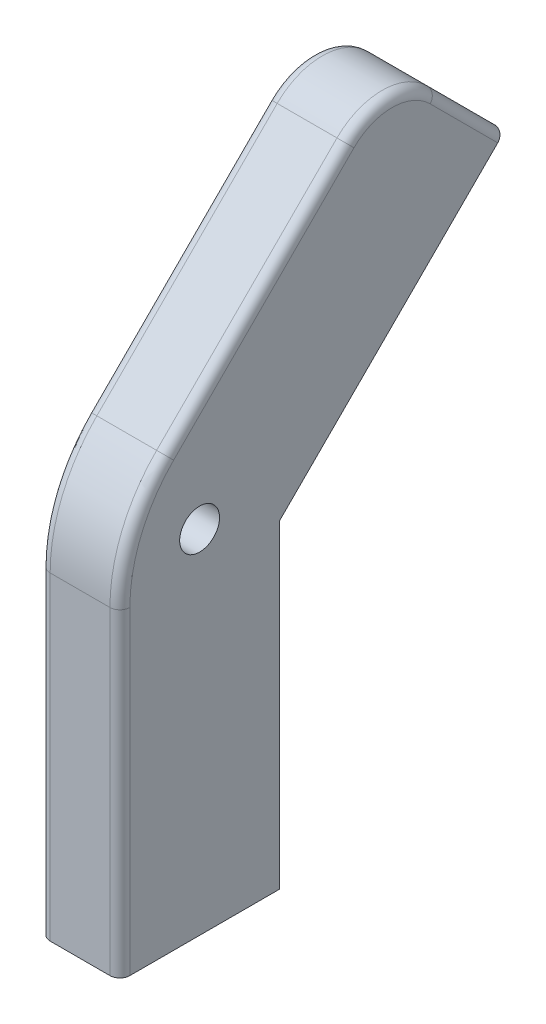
from build123d import *

# Parameters (mm, degrees)
EXTRUDE1_DEPTH = 3.175
SKETCH2_R      = 0.79375
EXTRUDE2_DEPTH = 21.653053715
FILLET2_R      = 2.54
FILLET3_R      = 0.396875


with BuildPart() as part:
    # Sketch1 → Extrude1 (new body)
    with BuildSketch(Plane(origin=(0, 0, 0), x_dir=(0, 0, -1), z_dir=(1, 0, 0))):
        with BuildLine():
            Line((6.35, 0), (15.330256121, 8.980256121))
            Line((15.330256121, 8.980256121), (10.840128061, 13.470384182))
            Line((10.840128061, 13.470384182), (1.859871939, 4.490128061))
            ThreePointArc((1.859871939, 4.490128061), (0.483364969, 2.430039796), (0, 0))
            Line((0, 0), (0, -12.7))
            Line((0, -12.7), (6.35, -12.7))
            Line((6.35, -12.7), (6.35, 0))
        make_face()
    extrude(amount=EXTRUDE1_DEPTH)

    # Sketch2 → Extrude2 (cut, through all)
    with BuildSketch(Plane(origin=(3.175, 0, 0), x_dir=(0, 0, -1), z_dir=(1, 0, 0))):
        with Locations((3.175, 1.315128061)):
            Circle(SKETCH2_R)
    extrude(amount=-EXTRUDE2_DEPTH, mode=Mode.SUBTRACT)

    # Fillet2
    fillet2_edges = [part.edges().sort_by_distance(p)[0] for p in [
        (1.5875, 13.470384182, -10.840128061),
    ]]
    fillet(fillet2_edges, radius=FILLET2_R)

    # Fillet3
    fillet3_edges = [part.edges().sort_by_distance(p)[0] for p in [
        (3.175, 10.327294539, -13.983217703),
        (0, 8.082230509, -5.451974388),
        (3.175, 8.082230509, -5.451974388),
        (3.175, 12.418281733, -10.840128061),
        (0, 12.418281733, -10.840128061),
        (3.175, 2.430039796, -0.483364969),
        (3.175, -6.35, 0),
        (0, 10.327294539, -13.983217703),
        (0, -6.35, 0),
        (0, 2.430039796, -0.483364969),
    ]]
    fillet(fillet3_edges, radius=FILLET3_R)


solid = part.part
